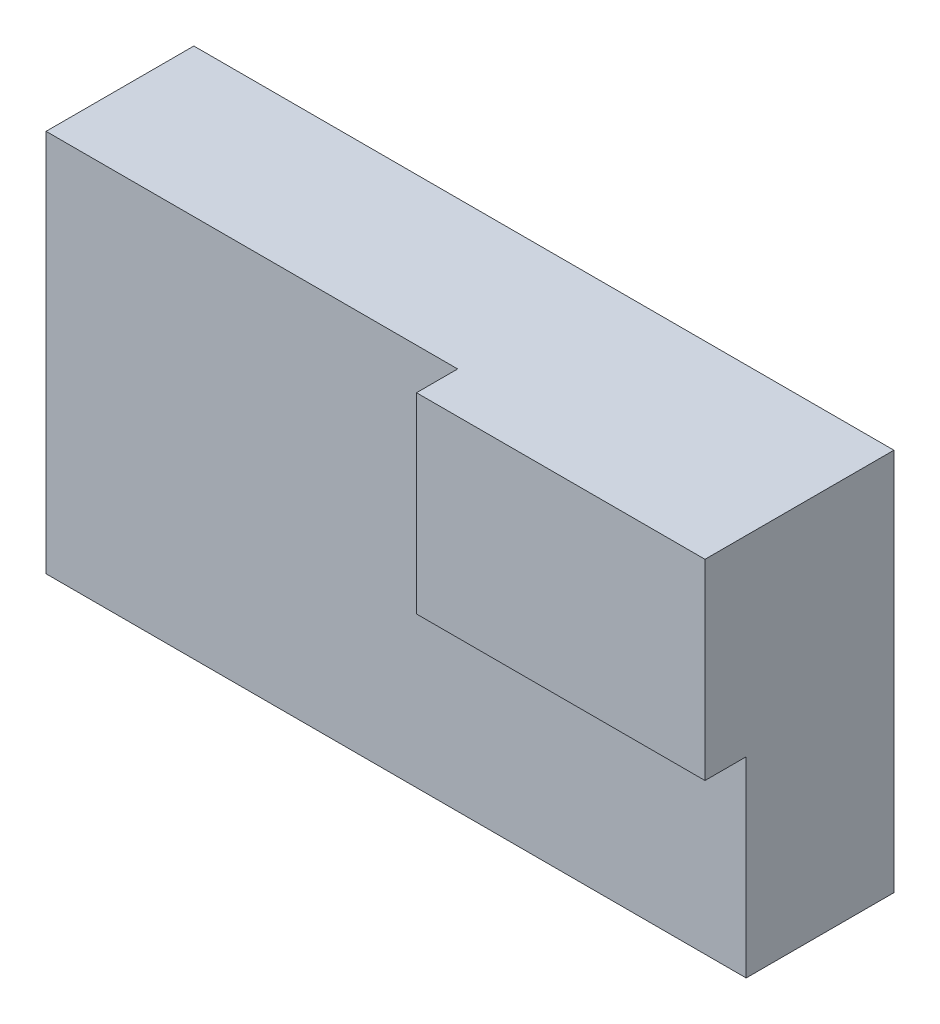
ISO-10303-21;
HEADER;
FILE_DESCRIPTION(('STEP AP214'),'2;1');
FILE_NAME('part.step','',(''),(''),'','','');
FILE_SCHEMA(('AUTOMOTIVE_DESIGN { 1 0 10303 214 1 1 1 1 }'));
ENDSEC;
DATA;
#1=APPLICATION_CONTEXT('core data for automotive mechanical design processes');
#2=APPLICATION_PROTOCOL_DEFINITION('international standard','automotive_design',2000,#1);
#3=PRODUCT_CONTEXT('',#1,'mechanical');
#4=PRODUCT('Part','Part','',(#3));
#5=PRODUCT_RELATED_PRODUCT_CATEGORY('part','',(#4));
#6=PRODUCT_DEFINITION_FORMATION('','',#4);
#7=PRODUCT_DEFINITION_CONTEXT('part definition',#1,'design');
#8=PRODUCT_DEFINITION('design','',#6,#7);
#9=PRODUCT_DEFINITION_SHAPE('','',#8);
#10=(LENGTH_UNIT() NAMED_UNIT(*) SI_UNIT(.MILLI.,.METRE.));
#11=(NAMED_UNIT(*) PLANE_ANGLE_UNIT() SI_UNIT($,.RADIAN.));
#12=(NAMED_UNIT(*) SI_UNIT($,.STERADIAN.) SOLID_ANGLE_UNIT());
#13=UNCERTAINTY_MEASURE_WITH_UNIT(LENGTH_MEASURE(1.E-05),#10,'distance_accuracy_value','');
#14=(GEOMETRIC_REPRESENTATION_CONTEXT(3) GLOBAL_UNCERTAINTY_ASSIGNED_CONTEXT((#13)) GLOBAL_UNIT_ASSIGNED_CONTEXT((#10,
#11,#12)) REPRESENTATION_CONTEXT('',''));
#15=CARTESIAN_POINT('',(0.,0.,0.));
#16=DIRECTION('',(0.,0.,1.));
#17=DIRECTION('',(1.,0.,0.));
#18=AXIS2_PLACEMENT_3D('',#15,#16,#17);
#19=CARTESIAN_POINT('',(-85.0123653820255,46.533357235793,35.8867617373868));
#20=DIRECTION('',(1.,0.,0.));
#21=DIRECTION('',(0.,1.,0.));
#22=AXIS2_PLACEMENT_3D('',#19,#20,#21);
#23=PLANE('',#22);
#24=DIRECTION('',(0.,-1.,0.));
#25=VECTOR('',#24,1.);
#26=CARTESIAN_POINT('',(-85.0123653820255,46.533357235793,0.));
#27=LINE('',#26,#25);
#28=CARTESIAN_POINT('',(-85.0123653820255,46.533357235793,0.));
#29=VERTEX_POINT('',#28);
#30=CARTESIAN_POINT('',(-85.0123653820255,-46.5333572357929,0.));
#31=VERTEX_POINT('',#30);
#32=EDGE_CURVE('E134',#29,#31,#27,.T.);
#33=ORIENTED_EDGE('',*,*,#32,.T.);
#34=DIRECTION('',(0.,0.,-1.));
#35=VECTOR('',#34,1.);
#36=CARTESIAN_POINT('',(-85.0123653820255,-46.5333572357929,35.8867617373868));
#37=LINE('',#36,#35);
#38=CARTESIAN_POINT('',(-85.0123653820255,-46.5333572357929,35.8867617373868));
#39=VERTEX_POINT('',#38);
#40=EDGE_CURVE('E11',#39,#31,#37,.T.);
#41=ORIENTED_EDGE('',*,*,#40,.F.);
#42=DIRECTION('',(0.,-1.,0.));
#43=VECTOR('',#42,1.);
#44=CARTESIAN_POINT('',(-85.0123653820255,46.533357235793,35.8867617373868));
#45=LINE('',#44,#43);
#46=CARTESIAN_POINT('',(-85.0123653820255,46.533357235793,35.8867617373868));
#47=VERTEX_POINT('',#46);
#48=EDGE_CURVE('E155',#47,#39,#45,.T.);
#49=ORIENTED_EDGE('',*,*,#48,.F.);
#50=DIRECTION('',(0.,0.,-1.));
#51=VECTOR('',#50,1.);
#52=CARTESIAN_POINT('',(-85.0123653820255,46.533357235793,35.8867617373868));
#53=LINE('',#52,#51);
#54=EDGE_CURVE('E102',#47,#29,#53,.T.);
#55=ORIENTED_EDGE('',*,*,#54,.T.);
#56=EDGE_LOOP('',(#33,#41,#49,#55));
#57=FACE_BOUND('',#56,.T.);
#58=ADVANCED_FACE('F32',(#57),#23,.F.);
#59=CARTESIAN_POINT('',(-85.0123653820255,-46.5333572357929,35.8867617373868));
#60=DIRECTION('',(0.,1.,0.));
#61=DIRECTION('',(0.,0.,1.));
#62=AXIS2_PLACEMENT_3D('',#59,#60,#61);
#63=PLANE('',#62);
#64=DIRECTION('',(1.,0.,0.));
#65=VECTOR('',#64,1.);
#66=CARTESIAN_POINT('',(-85.0123653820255,-46.5333572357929,0.));
#67=LINE('',#66,#65);
#68=CARTESIAN_POINT('',(85.0123653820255,-46.5333572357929,0.));
#69=VERTEX_POINT('',#68);
#70=EDGE_CURVE('E137',#31,#69,#67,.T.);
#71=ORIENTED_EDGE('',*,*,#70,.T.);
#72=DIRECTION('',(0.,0.,-1.));
#73=VECTOR('',#72,1.);
#74=CARTESIAN_POINT('',(85.0123653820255,-46.5333572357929,35.8867617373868));
#75=LINE('',#74,#73);
#76=CARTESIAN_POINT('',(85.0123653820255,-46.5333572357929,35.8867617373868));
#77=VERTEX_POINT('',#76);
#78=EDGE_CURVE('E40',#77,#69,#75,.T.);
#79=ORIENTED_EDGE('',*,*,#78,.F.);
#80=DIRECTION('',(1.,0.,0.));
#81=VECTOR('',#80,1.);
#82=CARTESIAN_POINT('',(-85.0123653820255,-46.5333572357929,35.8867617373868));
#83=LINE('',#82,#81);
#84=EDGE_CURVE('E168',#39,#77,#83,.T.);
#85=ORIENTED_EDGE('',*,*,#84,.F.);
#86=ORIENTED_EDGE('',*,*,#40,.T.);
#87=EDGE_LOOP('',(#71,#79,#85,#86));
#88=FACE_BOUND('',#87,.T.);
#89=ADVANCED_FACE('F170',(#88),#63,.F.);
#90=CARTESIAN_POINT('',(85.0123653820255,46.533357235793,35.8867617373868));
#91=DIRECTION('',(-1.,0.,0.));
#92=DIRECTION('',(0.,0.,1.));
#93=AXIS2_PLACEMENT_3D('',#90,#91,#92);
#94=PLANE('',#93);
#95=DIRECTION('',(0.,1.,0.));
#96=VECTOR('',#95,1.);
#97=CARTESIAN_POINT('',(85.0123653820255,46.533357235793,0.));
#98=LINE('',#97,#96);
#99=CARTESIAN_POINT('',(85.0123653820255,46.533357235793,0.));
#100=VERTEX_POINT('',#99);
#101=EDGE_CURVE('E99',#69,#100,#98,.T.);
#102=ORIENTED_EDGE('',*,*,#101,.T.);
#103=DIRECTION('',(0.,0.,-1.));
#104=VECTOR('',#103,1.);
#105=CARTESIAN_POINT('',(85.0123653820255,46.533357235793,35.8867617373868));
#106=LINE('',#105,#104);
#107=CARTESIAN_POINT('',(85.0123653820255,46.533357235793,45.8867617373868));
#108=VERTEX_POINT('',#107);
#109=EDGE_CURVE('E91',#108,#100,#106,.T.);
#110=ORIENTED_EDGE('',*,*,#109,.F.);
#111=DIRECTION('',(0.,1.,0.));
#112=VECTOR('',#111,1.);
#113=CARTESIAN_POINT('',(85.0123653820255,46.533357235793,45.8867617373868));
#114=LINE('',#113,#112);
#115=CARTESIAN_POINT('',(85.0123653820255,0.,45.8867617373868));
#116=VERTEX_POINT('',#115);
#117=EDGE_CURVE('E96',#116,#108,#114,.T.);
#118=ORIENTED_EDGE('',*,*,#117,.F.);
#119=DIRECTION('',(0.,0.,-1.));
#120=VECTOR('',#119,1.);
#121=CARTESIAN_POINT('',(85.0123653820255,0.,45.8867617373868));
#122=LINE('',#121,#120);
#123=CARTESIAN_POINT('',(85.0123653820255,0.,35.8867617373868));
#124=VERTEX_POINT('',#123);
#125=EDGE_CURVE('E123',#116,#124,#122,.T.);
#126=ORIENTED_EDGE('',*,*,#125,.T.);
#127=DIRECTION('',(0.,1.,0.));
#128=VECTOR('',#127,1.);
#129=CARTESIAN_POINT('',(85.0123653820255,46.533357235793,35.8867617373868));
#130=LINE('',#129,#128);
#131=EDGE_CURVE('E54',#77,#124,#130,.T.);
#132=ORIENTED_EDGE('',*,*,#131,.F.);
#133=ORIENTED_EDGE('',*,*,#78,.T.);
#134=EDGE_LOOP('',(#102,#110,#118,#126,#132,#133));
#135=FACE_BOUND('',#134,.T.);
#136=ADVANCED_FACE('F93',(#135),#94,.F.);
#137=CARTESIAN_POINT('',(-85.0123653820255,46.533357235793,35.8867617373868));
#138=DIRECTION('',(0.,-1.,0.));
#139=DIRECTION('',(0.,0.,-1.));
#140=AXIS2_PLACEMENT_3D('',#137,#138,#139);
#141=PLANE('',#140);
#142=DIRECTION('',(-1.,0.,0.));
#143=VECTOR('',#142,1.);
#144=CARTESIAN_POINT('',(-85.0123653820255,46.533357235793,0.));
#145=LINE('',#144,#143);
#146=EDGE_CURVE('E153',#100,#29,#145,.T.);
#147=ORIENTED_EDGE('',*,*,#146,.T.);
#148=ORIENTED_EDGE('',*,*,#54,.F.);
#149=DIRECTION('',(-1.,0.,0.));
#150=VECTOR('',#149,1.);
#151=CARTESIAN_POINT('',(-85.0123653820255,46.533357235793,35.8867617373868));
#152=LINE('',#151,#150);
#153=CARTESIAN_POINT('',(14.9504504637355,46.533357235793,35.8867617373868));
#154=VERTEX_POINT('',#153);
#155=EDGE_CURVE('E143',#154,#47,#152,.T.);
#156=ORIENTED_EDGE('',*,*,#155,.F.);
#157=DIRECTION('',(0.,0.,-1.));
#158=VECTOR('',#157,1.);
#159=CARTESIAN_POINT('',(14.9504504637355,46.533357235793,45.8867617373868));
#160=LINE('',#159,#158);
#161=CARTESIAN_POINT('',(14.9504504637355,46.533357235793,45.8867617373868));
#162=VERTEX_POINT('',#161);
#163=EDGE_CURVE('E108',#162,#154,#160,.T.);
#164=ORIENTED_EDGE('',*,*,#163,.F.);
#165=DIRECTION('',(-1.,0.,0.));
#166=VECTOR('',#165,1.);
#167=CARTESIAN_POINT('',(85.0123653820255,46.533357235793,45.8867617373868));
#168=LINE('',#167,#166);
#169=EDGE_CURVE('E105',#108,#162,#168,.T.);
#170=ORIENTED_EDGE('',*,*,#169,.F.);
#171=ORIENTED_EDGE('',*,*,#109,.T.);
#172=EDGE_LOOP('',(#147,#148,#156,#164,#170,#171));
#173=FACE_BOUND('',#172,.T.);
#174=ADVANCED_FACE('F106',(#173),#141,.F.);
#175=CARTESIAN_POINT('',(-85.0123653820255,-46.5333572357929,35.8867617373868));
#176=DIRECTION('',(0.,0.,1.));
#177=DIRECTION('',(1.,0.,0.));
#178=AXIS2_PLACEMENT_3D('',#175,#176,#177);
#179=PLANE('',#178);
#180=DIRECTION('',(1.,0.,0.));
#181=VECTOR('',#180,1.);
#182=CARTESIAN_POINT('',(85.0123653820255,0.,35.8867617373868));
#183=LINE('',#182,#181);
#184=CARTESIAN_POINT('',(14.9504504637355,0.,35.8867617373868));
#185=VERTEX_POINT('',#184);
#186=EDGE_CURVE('E117',#185,#124,#183,.T.);
#187=ORIENTED_EDGE('',*,*,#186,.F.);
#188=DIRECTION('',(0.,-1.,0.));
#189=VECTOR('',#188,1.);
#190=CARTESIAN_POINT('',(14.9504504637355,46.533357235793,35.8867617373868));
#191=LINE('',#190,#189);
#192=EDGE_CURVE('E48',#154,#185,#191,.T.);
#193=ORIENTED_EDGE('',*,*,#192,.F.);
#194=ORIENTED_EDGE('',*,*,#155,.T.);
#195=ORIENTED_EDGE('',*,*,#48,.T.);
#196=ORIENTED_EDGE('',*,*,#84,.T.);
#197=ORIENTED_EDGE('',*,*,#131,.T.);
#198=EDGE_LOOP('',(#187,#193,#194,#195,#196,#197));
#199=FACE_BOUND('',#198,.T.);
#200=ADVANCED_FACE('F169',(#199),#179,.T.);
#201=CARTESIAN_POINT('',(-85.0123653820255,-46.5333572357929,0.));
#202=DIRECTION('',(0.,0.,1.));
#203=DIRECTION('',(1.,0.,0.));
#204=AXIS2_PLACEMENT_3D('',#201,#202,#203);
#205=PLANE('',#204);
#206=ORIENTED_EDGE('',*,*,#32,.F.);
#207=ORIENTED_EDGE('',*,*,#146,.F.);
#208=ORIENTED_EDGE('',*,*,#101,.F.);
#209=ORIENTED_EDGE('',*,*,#70,.F.);
#210=EDGE_LOOP('',(#206,#207,#208,#209));
#211=FACE_BOUND('',#210,.T.);
#212=ADVANCED_FACE('F162',(#211),#205,.F.);
#213=CARTESIAN_POINT('',(14.9504504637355,46.533357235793,45.8867617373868));
#214=DIRECTION('',(1.,0.,0.));
#215=DIRECTION('',(0.,0.,-1.));
#216=AXIS2_PLACEMENT_3D('',#213,#214,#215);
#217=PLANE('',#216);
#218=ORIENTED_EDGE('',*,*,#192,.T.);
#219=DIRECTION('',(0.,0.,-1.));
#220=VECTOR('',#219,1.);
#221=CARTESIAN_POINT('',(14.9504504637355,0.,45.8867617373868));
#222=LINE('',#221,#220);
#223=CARTESIAN_POINT('',(14.9504504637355,0.,45.8867617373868));
#224=VERTEX_POINT('',#223);
#225=EDGE_CURVE('E126',#224,#185,#222,.T.);
#226=ORIENTED_EDGE('',*,*,#225,.F.);
#227=DIRECTION('',(0.,-1.,0.));
#228=VECTOR('',#227,1.);
#229=CARTESIAN_POINT('',(14.9504504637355,46.533357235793,45.8867617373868));
#230=LINE('',#229,#228);
#231=EDGE_CURVE('E111',#162,#224,#230,.T.);
#232=ORIENTED_EDGE('',*,*,#231,.F.);
#233=ORIENTED_EDGE('',*,*,#163,.T.);
#234=EDGE_LOOP('',(#218,#226,#232,#233));
#235=FACE_BOUND('',#234,.T.);
#236=ADVANCED_FACE('F182',(#235),#217,.F.);
#237=CARTESIAN_POINT('',(85.0123653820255,0.,45.8867617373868));
#238=DIRECTION('',(0.,1.,0.));
#239=DIRECTION('',(0.,0.,1.));
#240=AXIS2_PLACEMENT_3D('',#237,#238,#239);
#241=PLANE('',#240);
#242=ORIENTED_EDGE('',*,*,#186,.T.);
#243=ORIENTED_EDGE('',*,*,#125,.F.);
#244=DIRECTION('',(1.,0.,0.));
#245=VECTOR('',#244,1.);
#246=CARTESIAN_POINT('',(85.0123653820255,0.,45.8867617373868));
#247=LINE('',#246,#245);
#248=EDGE_CURVE('E115',#224,#116,#247,.T.);
#249=ORIENTED_EDGE('',*,*,#248,.F.);
#250=ORIENTED_EDGE('',*,*,#225,.T.);
#251=EDGE_LOOP('',(#242,#243,#249,#250));
#252=FACE_BOUND('',#251,.T.);
#253=ADVANCED_FACE('F187',(#252),#241,.F.);
#254=CARTESIAN_POINT('',(85.0123653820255,0.,45.8867617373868));
#255=DIRECTION('',(0.,0.,-1.));
#256=DIRECTION('',(-1.,0.,0.));
#257=AXIS2_PLACEMENT_3D('',#254,#255,#256);
#258=PLANE('',#257);
#259=ORIENTED_EDGE('',*,*,#117,.T.);
#260=ORIENTED_EDGE('',*,*,#169,.T.);
#261=ORIENTED_EDGE('',*,*,#231,.T.);
#262=ORIENTED_EDGE('',*,*,#248,.T.);
#263=EDGE_LOOP('',(#259,#260,#261,#262));
#264=FACE_BOUND('',#263,.T.);
#265=ADVANCED_FACE('F113',(#264),#258,.F.);
#266=CLOSED_SHELL('',(#58,#89,#136,#174,#200,#212,#236,#253,#265));
#267=MANIFOLD_SOLID_BREP('B2',#266);
#268=ADVANCED_BREP_SHAPE_REPRESENTATION('',(#18,#267),#14);
#269=SHAPE_DEFINITION_REPRESENTATION(#9,#268);
ENDSEC;
END-ISO-10303-21;
